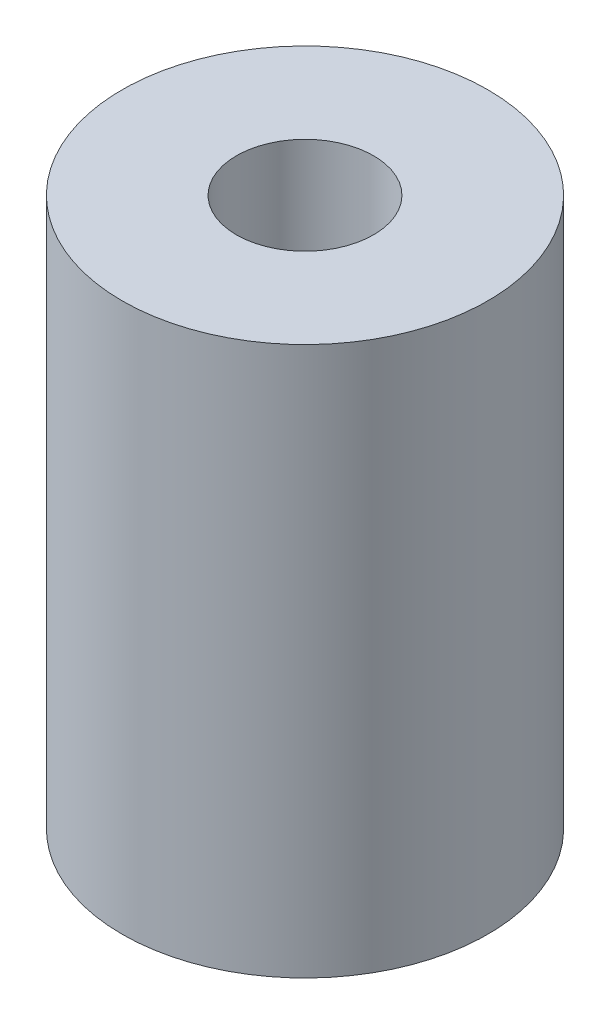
ISO-10303-21;
HEADER;
FILE_DESCRIPTION(('STEP AP214'),'2;1');
FILE_NAME('part.step','',(''),(''),'','','');
FILE_SCHEMA(('AUTOMOTIVE_DESIGN { 1 0 10303 214 1 1 1 1 }'));
ENDSEC;
DATA;
#1=APPLICATION_CONTEXT('core data for automotive mechanical design processes');
#2=APPLICATION_PROTOCOL_DEFINITION('international standard','automotive_design',2000,#1);
#3=PRODUCT_CONTEXT('',#1,'mechanical');
#4=PRODUCT('Part','Part','',(#3));
#5=PRODUCT_RELATED_PRODUCT_CATEGORY('part','',(#4));
#6=PRODUCT_DEFINITION_FORMATION('','',#4);
#7=PRODUCT_DEFINITION_CONTEXT('part definition',#1,'design');
#8=PRODUCT_DEFINITION('design','',#6,#7);
#9=PRODUCT_DEFINITION_SHAPE('','',#8);
#10=(LENGTH_UNIT() NAMED_UNIT(*) SI_UNIT(.MILLI.,.METRE.));
#11=(NAMED_UNIT(*) PLANE_ANGLE_UNIT() SI_UNIT($,.RADIAN.));
#12=(NAMED_UNIT(*) SI_UNIT($,.STERADIAN.) SOLID_ANGLE_UNIT());
#13=UNCERTAINTY_MEASURE_WITH_UNIT(LENGTH_MEASURE(1.E-05),#10,'distance_accuracy_value','');
#14=(GEOMETRIC_REPRESENTATION_CONTEXT(3) GLOBAL_UNCERTAINTY_ASSIGNED_CONTEXT((#13)) GLOBAL_UNIT_ASSIGNED_CONTEXT((#10,
#11,#12)) REPRESENTATION_CONTEXT('',''));
#15=CARTESIAN_POINT('',(0.,0.,0.));
#16=DIRECTION('',(0.,0.,1.));
#17=DIRECTION('',(1.,0.,0.));
#18=AXIS2_PLACEMENT_3D('',#15,#16,#17);
#19=CARTESIAN_POINT('',(0.,-38.1,0.));
#20=DIRECTION('',(0.,1.,0.));
#21=DIRECTION('',(0.,0.,1.));
#22=AXIS2_PLACEMENT_3D('',#19,#20,#21);
#23=CYLINDRICAL_SURFACE('',#22,12.7);
#24=CARTESIAN_POINT('',(0.,-38.1,0.));
#25=DIRECTION('',(0.,1.,0.));
#26=DIRECTION('',(0.,0.,1.));
#27=AXIS2_PLACEMENT_3D('',#24,#25,#26);
#28=CIRCLE('',#27,12.7);
#29=CARTESIAN_POINT('',(0.,-38.1,12.7));
#30=VERTEX_POINT('',#29);
#31=EDGE_CURVE('E10',#30,#30,#28,.T.);
#32=CARTESIAN_POINT('',(0.,0.,0.));
#33=DIRECTION('',(0.,1.,0.));
#34=DIRECTION('',(0.,0.,1.));
#35=AXIS2_PLACEMENT_3D('',#32,#33,#34);
#36=CIRCLE('',#35,12.7);
#37=CARTESIAN_POINT('',(0.,0.,12.7));
#38=VERTEX_POINT('',#37);
#39=EDGE_CURVE('E35',#38,#38,#36,.T.);
#40=CARTESIAN_POINT('',(0.,-38.1,12.7));
#41=CARTESIAN_POINT('',(0.,-37.703125,12.7));
#42=CARTESIAN_POINT('',(0.,-37.30625,12.7));
#43=CARTESIAN_POINT('',(0.,-36.5125,12.7));
#44=CARTESIAN_POINT('',(0.,-36.115625,12.7));
#45=CARTESIAN_POINT('',(0.,-35.321875,12.7));
#46=CARTESIAN_POINT('',(0.,-34.925,12.7));
#47=CARTESIAN_POINT('',(0.,-34.13125,12.7));
#48=CARTESIAN_POINT('',(0.,-33.734375,12.7));
#49=CARTESIAN_POINT('',(0.,-32.940625,12.7));
#50=CARTESIAN_POINT('',(0.,-32.54375,12.7));
#51=CARTESIAN_POINT('',(0.,-31.75,12.7));
#52=CARTESIAN_POINT('',(0.,-31.353125,12.7));
#53=CARTESIAN_POINT('',(0.,-30.559375,12.7));
#54=CARTESIAN_POINT('',(0.,-30.1625,12.7));
#55=CARTESIAN_POINT('',(0.,-29.36875,12.7));
#56=CARTESIAN_POINT('',(0.,-28.971875,12.7));
#57=CARTESIAN_POINT('',(0.,-28.178125,12.7));
#58=CARTESIAN_POINT('',(0.,-27.78125,12.7));
#59=CARTESIAN_POINT('',(0.,-26.9875,12.7));
#60=CARTESIAN_POINT('',(0.,-26.590625,12.7));
#61=CARTESIAN_POINT('',(0.,-25.796875,12.7));
#62=CARTESIAN_POINT('',(0.,-25.4,12.7));
#63=CARTESIAN_POINT('',(0.,-24.60625,12.7));
#64=CARTESIAN_POINT('',(0.,-24.209375,12.7));
#65=CARTESIAN_POINT('',(0.,-23.415625,12.7));
#66=CARTESIAN_POINT('',(0.,-23.01875,12.7));
#67=CARTESIAN_POINT('',(0.,-22.225,12.7));
#68=CARTESIAN_POINT('',(0.,-21.828125,12.7));
#69=CARTESIAN_POINT('',(0.,-21.034375,12.7));
#70=CARTESIAN_POINT('',(0.,-20.6375,12.7));
#71=CARTESIAN_POINT('',(0.,-19.84375,12.7));
#72=CARTESIAN_POINT('',(0.,-19.446875,12.7));
#73=CARTESIAN_POINT('',(0.,-18.653125,12.7));
#74=CARTESIAN_POINT('',(0.,-18.25625,12.7));
#75=CARTESIAN_POINT('',(0.,-17.4625,12.7));
#76=CARTESIAN_POINT('',(0.,-17.065625,12.7));
#77=CARTESIAN_POINT('',(0.,-16.271875,12.7));
#78=CARTESIAN_POINT('',(0.,-15.875,12.7));
#79=CARTESIAN_POINT('',(0.,-15.08125,12.7));
#80=CARTESIAN_POINT('',(0.,-14.684375,12.7));
#81=CARTESIAN_POINT('',(0.,-13.890625,12.7));
#82=CARTESIAN_POINT('',(0.,-13.49375,12.7));
#83=CARTESIAN_POINT('',(0.,-12.7,12.7));
#84=CARTESIAN_POINT('',(0.,-12.303125,12.7));
#85=CARTESIAN_POINT('',(0.,-11.509375,12.7));
#86=CARTESIAN_POINT('',(0.,-11.1125,12.7));
#87=CARTESIAN_POINT('',(0.,-10.31875,12.7));
#88=CARTESIAN_POINT('',(0.,-9.921875,12.7));
#89=CARTESIAN_POINT('',(0.,-9.128125,12.7));
#90=CARTESIAN_POINT('',(0.,-8.73125,12.7));
#91=CARTESIAN_POINT('',(0.,-7.9375,12.7));
#92=CARTESIAN_POINT('',(0.,-7.540625,12.7));
#93=CARTESIAN_POINT('',(0.,-6.746875,12.7));
#94=CARTESIAN_POINT('',(0.,-6.35,12.7));
#95=CARTESIAN_POINT('',(0.,-5.55625,12.7));
#96=CARTESIAN_POINT('',(0.,-5.159375,12.7));
#97=CARTESIAN_POINT('',(0.,-4.365625,12.7));
#98=CARTESIAN_POINT('',(0.,-3.96875,12.7));
#99=CARTESIAN_POINT('',(0.,-3.175,12.7));
#100=CARTESIAN_POINT('',(0.,-2.778125,12.7));
#101=CARTESIAN_POINT('',(0.,-1.984375,12.7));
#102=CARTESIAN_POINT('',(0.,-1.5875,12.7));
#103=CARTESIAN_POINT('',(0.,-0.79375,12.7));
#104=CARTESIAN_POINT('',(0.,-0.396875,12.7));
#105=CARTESIAN_POINT('',(0.,0.,12.7));
#106=B_SPLINE_CURVE_WITH_KNOTS('',3,(#40,#41,#42,#43,#44,#45,#46,#47,#48,#49,#50,#51,#52,#53,
#54,#55,#56,#57,#58,#59,#60,#61,#62,#63,#64,#65,#66,#67,#68,#69,#70,#71,#72,#73,#74,#75,#76,#77,
#78,#79,#80,#81,#82,#83,#84,#85,#86,#87,#88,#89,#90,#91,#92,#93,#94,#95,#96,#97,#98,#99,#100,
#101,#102,#103,#104,#105),.UNSPECIFIED.,.F.,.F.,(4,2,2,2,2,2,2,2,2,2,2,2,2,2,2,2,2,2,2,2,2,2,2,
2,2,2,2,2,2,2,2,2,4),(0.,1.19062499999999,2.38124999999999,3.571875,4.7625,5.953125,7.14375,
8.334375,9.525,10.715625,11.90625,13.096875,14.2875,15.478125,16.66875,17.859375,19.05,
20.240625,21.43125,22.621875,23.8125,25.003125,26.19375,27.384375,28.575,29.765625,30.95625,
32.146875,33.3375,34.528125,35.71875,36.909375,38.1),.UNSPECIFIED.);
#107=EDGE_CURVE('BSEAM32',#30,#38,#106,.T.);
#108=ORIENTED_EDGE('',*,*,#31,.T.);
#109=ORIENTED_EDGE('',*,*,#39,.F.);
#110=ORIENTED_EDGE('',*,*,#107,.T.);
#111=ORIENTED_EDGE('',*,*,#107,.F.);
#112=EDGE_LOOP('',(#108,#110,#109,#111));
#113=FACE_BOUND('',#112,.T.);
#114=ADVANCED_FACE('F32',(#113),#23,.T.);
#115=CARTESIAN_POINT('',(0.,-38.1,0.));
#116=DIRECTION('',(0.,1.,0.));
#117=DIRECTION('',(0.,0.,1.));
#118=AXIS2_PLACEMENT_3D('',#115,#116,#117);
#119=PLANE('',#118);
#120=CARTESIAN_POINT('',(0.,-38.1,0.));
#121=DIRECTION('',(0.,-1.,0.));
#122=DIRECTION('',(0.,0.,-1.));
#123=AXIS2_PLACEMENT_3D('',#120,#121,#122);
#124=CIRCLE('',#123,3.175);
#125=CARTESIAN_POINT('',(0.,-38.1,-3.175));
#126=VERTEX_POINT('',#125);
#127=EDGE_CURVE('E44',#126,#126,#124,.T.);
#128=ORIENTED_EDGE('',*,*,#127,.F.);
#129=EDGE_LOOP('',(#128));
#130=FACE_BOUND('',#129,.T.);
#131=ORIENTED_EDGE('',*,*,#31,.F.);
#132=EDGE_LOOP('',(#131));
#133=FACE_BOUND('',#132,.T.);
#134=ADVANCED_FACE('F69',(#130,#133),#119,.F.);
#135=CARTESIAN_POINT('',(0.,0.,0.));
#136=DIRECTION('',(0.,1.,0.));
#137=DIRECTION('',(0.,0.,1.));
#138=AXIS2_PLACEMENT_3D('',#135,#136,#137);
#139=PLANE('',#138);
#140=CARTESIAN_POINT('',(0.,0.,0.));
#141=DIRECTION('',(0.,1.,0.));
#142=DIRECTION('',(0.,0.,1.));
#143=AXIS2_PLACEMENT_3D('',#140,#141,#142);
#144=CIRCLE('',#143,4.7625);
#145=CARTESIAN_POINT('',(0.,0.,4.7625));
#146=VERTEX_POINT('',#145);
#147=EDGE_CURVE('E50',#146,#146,#144,.T.);
#148=ORIENTED_EDGE('',*,*,#147,.F.);
#149=EDGE_LOOP('',(#148));
#150=FACE_BOUND('',#149,.T.);
#151=ORIENTED_EDGE('',*,*,#39,.T.);
#152=EDGE_LOOP('',(#151));
#153=FACE_BOUND('',#152,.T.);
#154=ADVANCED_FACE('F65',(#150,#153),#139,.T.);
#155=CARTESIAN_POINT('',(0.,-21.082,0.));
#156=DIRECTION('',(0.,-1.,0.));
#157=DIRECTION('',(0.,0.,-1.));
#158=AXIS2_PLACEMENT_3D('',#155,#156,#157);
#159=CYLINDRICAL_SURFACE('',#158,3.175);
#160=CARTESIAN_POINT('',(0.,-21.082,0.));
#161=DIRECTION('',(0.,-1.,0.));
#162=DIRECTION('',(0.,0.,-1.));
#163=AXIS2_PLACEMENT_3D('',#160,#161,#162);
#164=CIRCLE('',#163,3.175);
#165=CARTESIAN_POINT('',(0.,-21.082,-3.175));
#166=VERTEX_POINT('',#165);
#167=EDGE_CURVE('E42',#166,#166,#164,.T.);
#168=ORIENTED_EDGE('',*,*,#167,.F.);
#169=EDGE_LOOP('',(#168));
#170=FACE_BOUND('',#169,.T.);
#171=ORIENTED_EDGE('',*,*,#127,.T.);
#172=EDGE_LOOP('',(#171));
#173=FACE_BOUND('',#172,.T.);
#174=ADVANCED_FACE('F68',(#170,#173),#159,.F.);
#175=CARTESIAN_POINT('',(0.,-21.082,0.));
#176=DIRECTION('',(0.,-1.,0.));
#177=DIRECTION('',(0.,0.,-1.));
#178=AXIS2_PLACEMENT_3D('',#175,#176,#177);
#179=PLANE('',#178);
#180=ORIENTED_EDGE('',*,*,#167,.T.);
#181=EDGE_LOOP('',(#180));
#182=FACE_BOUND('',#181,.T.);
#183=ADVANCED_FACE('F61',(#182),#179,.T.);
#184=CARTESIAN_POINT('',(0.,-17.018,0.));
#185=DIRECTION('',(0.,1.,0.));
#186=DIRECTION('',(0.,0.,1.));
#187=AXIS2_PLACEMENT_3D('',#184,#185,#186);
#188=CYLINDRICAL_SURFACE('',#187,4.7625);
#189=CARTESIAN_POINT('',(0.,-17.018,0.));
#190=DIRECTION('',(0.,1.,0.));
#191=DIRECTION('',(0.,0.,1.));
#192=AXIS2_PLACEMENT_3D('',#189,#190,#191);
#193=CIRCLE('',#192,4.7625);
#194=CARTESIAN_POINT('',(0.,-17.018,4.7625));
#195=VERTEX_POINT('',#194);
#196=EDGE_CURVE('E47',#195,#195,#193,.T.);
#197=ORIENTED_EDGE('',*,*,#196,.F.);
#198=EDGE_LOOP('',(#197));
#199=FACE_BOUND('',#198,.T.);
#200=ORIENTED_EDGE('',*,*,#147,.T.);
#201=EDGE_LOOP('',(#200));
#202=FACE_BOUND('',#201,.T.);
#203=ADVANCED_FACE('F58',(#199,#202),#188,.F.);
#204=CARTESIAN_POINT('',(0.,-17.018,0.));
#205=DIRECTION('',(0.,1.,0.));
#206=DIRECTION('',(0.,0.,1.));
#207=AXIS2_PLACEMENT_3D('',#204,#205,#206);
#208=PLANE('',#207);
#209=ORIENTED_EDGE('',*,*,#196,.T.);
#210=EDGE_LOOP('',(#209));
#211=FACE_BOUND('',#210,.T.);
#212=ADVANCED_FACE('F56',(#211),#208,.T.);
#213=CLOSED_SHELL('',(#114,#134,#154,#174,#183,#203,#212));
#214=MANIFOLD_SOLID_BREP('B2',#213);
#215=ADVANCED_BREP_SHAPE_REPRESENTATION('',(#18,#214),#14);
#216=SHAPE_DEFINITION_REPRESENTATION(#9,#215);
ENDSEC;
END-ISO-10303-21;
